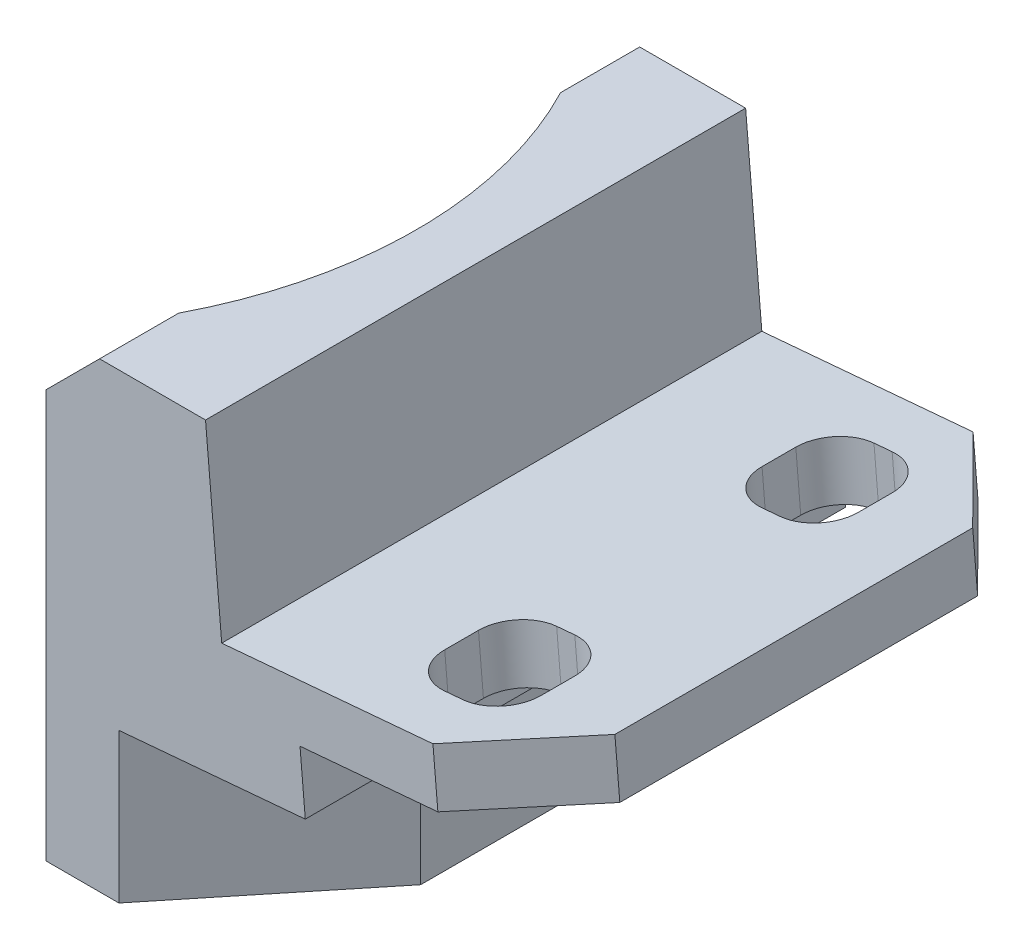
from build123d import *

# Parameters (mm, degrees)
EXTRUDE1_DEPTH              = 10.16
EXTRUDE1_DEPTH_BACK         = 10.16
EXTRUDE2_DEPTH              = 19.475775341
CHAMFER2_SIZE               = 5.08
CHAMFER2_SIZE2              = 6.273277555
CHAMFER3_SIZE               = 5.08
CHAMFER3_SIZE2              = 6.273277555
F_32_0_116_DIAMETER_HOLE1_D = 2.9464
CUT_EXTRUDE1_DEPTH          = 38.7206145
CUT_EXTRUDE1_DEPTH_BACK     = 38.7206145
SKETCH8_W                   = 1.245655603
SKETCH8_H                   = 20.32
CUT_EXTRUDE3_DEPTH          = 34.427980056
CHAMFER4_SIZE               = 3.429
SKETCH9_W                   = 8.347725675
SKETCH9_H                   = 20.32
CUT_EXTRUDE4_DEPTH          = 0.5842
CUT_EXTRUDE5_DEPTH          = 34.811609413
SKETCH11_W                  = 8.636
SKETCH11_H                  = 20.32
CUT_EXTRUDE6_DEPTH          = 2.286
SKETCH12_R                  = 15.5702
CUT_EXTRUDE7_DEPTH          = 38.259242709
SKETCH13_R                  = 28.860031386
CUT_EXTRUDE8_DEPTH          = 1.524


with BuildPart() as part:
    # Sketch1 → Extrude1 (new, two sides: drawn at the far end of the back side and taken through both)
    with BuildSketch(Plane.XY.offset(-EXTRUDE1_DEPTH_BACK)):
        Polygon((15.5575, 0), (15.5575, -19.475775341), (20.1295, -19.475775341), (20.1295, -11.296975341), (30.664528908, -10.375279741), (30.279335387, -5.972497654), (20.157997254, -6.858), (19.558, 0), align=None)
    extrude(amount=EXTRUDE1_DEPTH + EXTRUDE1_DEPTH_BACK)

    # Sketch2 → Extrude2 (add)
    with BuildSketch(Plane(origin=(0, 0, 0), x_dir=(1, 0, 0), z_dir=(0, 1, 0))):
        with BuildLine():
            Line((11.781774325, 10.16), (16.601653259, 10.16))
            Line((16.601653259, 10.16), (16.601653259, -10.16))
            Line((16.601653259, -10.16), (11.781774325, -10.16))
            ThreePointArc((11.781774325, -10.16), (15.5575, 0), (11.781774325, 10.16))
        make_face()
    extrude(amount=-EXTRUDE2_DEPTH)

    # Chamfer2
    chamfer2_edges = [part.edges().sort_by_distance(p)[0] for p in [
        (20.1295, -15.386375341, -10.16),
    ]]
    chamfer2_side = [part.faces().sort_by_distance(p)[0] for p in [
        (17.995328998, -9.562303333, -10.16),
    ]]
    chamfer(chamfer2_edges, length=CHAMFER2_SIZE, length2=CHAMFER2_SIZE2, reference=chamfer2_side[0])

    # Chamfer3
    chamfer3_edges = [part.edges().sort_by_distance(p)[0] for p in [
        (20.1295, -15.386375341, 10.16),
    ]]
    chamfer3_side = [part.faces().sort_by_distance(p)[0] for p in [
        (17.995328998, -9.562303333, 10.16),
    ]]
    chamfer(chamfer3_edges, length=CHAMFER3_SIZE, length2=CHAMFER3_SIZE2, reference=chamfer3_side[0])

    # 32 _0.116_ Diameter Hole1 (through all)
    with Locations(Plane(origin=(1.133755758, -12.958887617, 0), x_dir=(0.9961946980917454, 0.08715574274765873, 0), z_dir=(0.08715574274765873, -0.9961946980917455, 0))):
        with Locations((24.563575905, 5.969)):
            f_32_0_116_diameter_hole1 = Hole(F_32_0_116_DIAMETER_HOLE1_D / 2)

    # Mirror1: 32 _0.116_ Diameter Hole1 across plane
    add(f_32_0_116_diameter_hole1.mirror(Plane.XY), mode=Mode.SUBTRACT)

    # Sketch5 → Cut-Extrude1 (cut, two sides: drawn at the far end of the back side and taken through both)
    with BuildSketch(Plane.XY.offset(-CUT_EXTRUDE1_DEPTH_BACK)):
        Polygon((11.781774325, 0), (14.321774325, 0), (11.781774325, -2.54), align=None)
    extrude(amount=CUT_EXTRUDE1_DEPTH + CUT_EXTRUDE1_DEPTH_BACK, mode=Mode.SUBTRACT)

    # Sketch8 → Cut-Extrude3 (cut, through all)
    with BuildSketch(Plane(origin=(0.748562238, -8.556105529, 0), x_dir=(-0.9961946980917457, -0.08715574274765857, 0), z_dir=(-0.08715574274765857, 0.9961946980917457, 0))):
        with Locations((-18.860748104, 0)):
            Rectangle(SKETCH8_W, SKETCH8_H)
    extrude(amount=CUT_EXTRUDE3_DEPTH, mode=Mode.SUBTRACT)

    # Chamfer4
    chamfer4_edges = [part.edges().sort_by_distance(p)[0] for p in [
        (30.471932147, -8.173888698, 10.16),
        (30.471932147, -8.173888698, -10.16),
    ]]
    chamfer(chamfer4_edges, length=CHAMFER4_SIZE)

    # Sketch9 → Cut-Extrude4 (cut)
    with BuildSketch(Plane.XZ.offset(19.475775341)):
        with Locations((15.955637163, 0)):
            Rectangle(SKETCH9_W, SKETCH9_H)
    extrude(amount=-CUT_EXTRUDE4_DEPTH, mode=Mode.SUBTRACT)

    # Sketch10 → Cut-Extrude5 (cut, through all)
    with BuildSketch(Plane(origin=(1.133755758, -12.958887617, 0), x_dir=(0.9961946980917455, 0.08715574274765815, 0), z_dir=(0.08715574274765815, -0.9961946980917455, 0))):
        with BuildLine():
            Line((23.090375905, 6.604), (23.090375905, 5.334))
            ThreePointArc((23.090375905, 5.334), (23.521866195, 4.29229029), (24.563575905, 3.8608))
            Line((24.563575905, 3.8608), (25.249375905, 3.8608))
            ThreePointArc((25.249375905, 3.8608), (26.291085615, 4.29229029), (26.722575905, 5.334))
            Line((26.722575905, 5.334), (26.722575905, 6.604))
            ThreePointArc((26.722575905, 6.604), (26.291085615, 7.64570971), (25.249375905, 8.0772))
            Line((25.249375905, 8.0772), (24.563575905, 8.0772))
            ThreePointArc((24.563575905, 8.0772), (23.521866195, 7.64570971), (23.090375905, 6.604))
        make_face()
    cut_extrude5 = extrude(amount=-CUT_EXTRUDE5_DEPTH, mode=Mode.SUBTRACT)

    # Mirror2: Cut-Extrude5 across plane
    add(cut_extrude5.mirror(Plane.XY), mode=Mode.SUBTRACT)

    # Sketch11 → Cut-Extrude6 (cut)
    with BuildSketch(Plane(origin=(1.133755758, -12.958887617, 0), x_dir=(0.9961946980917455, 0.08715574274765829, 0), z_dir=(0.08715574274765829, -0.9961946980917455, 0))):
        with Locations((25.325575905, 0)):
            Rectangle(SKETCH11_W, SKETCH11_H)
    extrude(amount=-CUT_EXTRUDE6_DEPTH, mode=Mode.SUBTRACT)

    # Sketch12 → Cut-Extrude7 (cut, through all)
    with BuildSketch(Plane.XZ.offset(18.891575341)):
        with Locations((0.508, 0)):
            Circle(SKETCH12_R)
    extrude(amount=-CUT_EXTRUDE7_DEPTH, mode=Mode.SUBTRACT)

    # Sketch13 → Cut-Extrude8 (cut)
    with BuildSketch(Plane.XZ.offset(18.891575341)):
        Circle(SKETCH13_R)
    extrude(amount=-CUT_EXTRUDE8_DEPTH, mode=Mode.SUBTRACT)


solid = part.part
